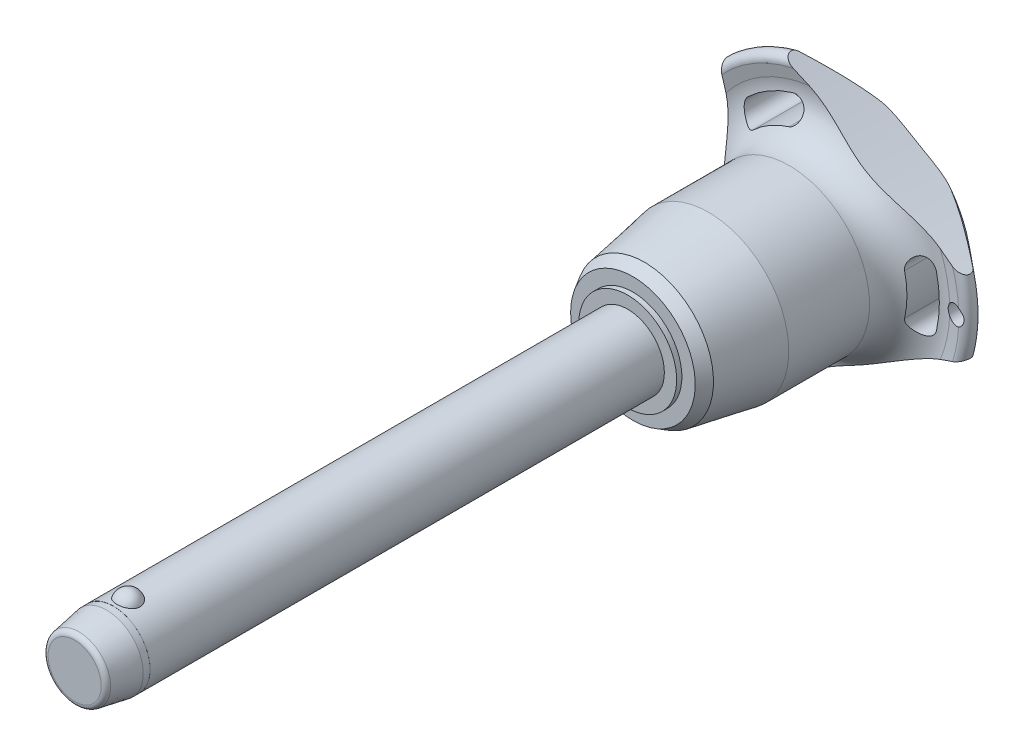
from build123d import *

# Parameters (mm, degrees)
SKETCH1_R           = 6
BOSS_EXTRUDE1_DEPTH = 80
SKETCH2_R           = 5.15
BOSS_EXTRUDE2_DEPTH = 39.7
BOSS_EXTRUDE3_START = 10.6
SKETCH1_2_R         = 6
BOSS_EXTRUDE3_DEPTH = 10.6
CHAMFER1_SIZE       = 5.3
CHAMFER1_SIZE2      = 0.934532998
FILLET1_R           = 0.85
SKETCH6_R           = 144.275
CUT_EXTRUDE1_DEPTH  = 125.345019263
CIRPATTERN1_COUNT   = 3
SKETCH7_R           = 1.5
CUT_EXTRUDE2_DEPTH  = 125.183516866
SKETCH8_R           = 6
SKETCH8_R_2         = 5.99
CUT_EXTRUDE3_DEPTH  = 6.36


with BuildPart() as part:
    # Sketch1 → Boss-Extrude1 (new body)
    with BuildSketch(Plane.XY):
        Circle(SKETCH1_R)
    extrude(amount=-BOSS_EXTRUDE1_DEPTH)

    # Sketch2 → Boss-Extrude2 (add)
    with BuildSketch(Plane(origin=(0, 0, -80), x_dir=(-1, 0, 0), z_dir=(0, 0, -1))):
        Circle(SKETCH2_R)
    extrude(amount=BOSS_EXTRUDE2_DEPTH)

    # Sketch3 → Revolve1 (revolve)
    with BuildSketch(Plane(origin=(0, 0, 0), x_dir=(0, 0, -1), z_dir=(1, 0, 0))):
        with BuildLine():
            Line((-1.854049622, 7.25), (-1.854049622, 3.25))
            ThreePointArc((-1.854049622, 3.25), (0.145950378, 5.25), (-1.854049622, 7.25))
        make_face()
        with BuildLine():
            Line((-1.854049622, -3.25), (-1.854049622, -7.25))
            ThreePointArc((-1.854049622, -7.25), (0.145950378, -5.25), (-1.854049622, -3.25))
        make_face()
    revolve(axis=Axis((0, -3.25, 1.854049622), (0, 1, 0)))

    # Sketch1_2 → Boss-Extrude3 (add)
    with BuildSketch(Plane.XY.offset(BOSS_EXTRUDE3_START)):
        Circle(SKETCH1_2_R)
    extrude(amount=-BOSS_EXTRUDE3_DEPTH)

    # Chamfer1
    chamfer1_edges = [part.edges().sort_by_distance(p)[0] for p in [
        (-6, 0, 10.6),
    ]]
    chamfer1_side = [part.faces().sort_by_distance(p)[0] for p in [
        (-6, 0, -34.7),
    ]]
    chamfer(chamfer1_edges, length=CHAMFER1_SIZE, length2=CHAMFER1_SIZE2, reference=chamfer1_side[0])

    # Fillet1
    fillet1_edges = [part.edges().sort_by_distance(p)[0] for p in [
        (-5.065467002, 0, 10.6),
        (5.15, 0, -119.7),
    ]]
    fillet(fillet1_edges, radius=FILLET1_R)

    # Sketch4 → Revolve2 (revolve)
    with BuildSketch(Plane(origin=(0, 0, 0), x_dir=(0, 0, -1), z_dir=(1, 0, 0)), mode=Mode.PRIVATE) as revolve2_sk:
        Polygon((80, 0), (80, 8.017240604), (80.85, 8.017240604), (80.85, 10.206249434), (82.745737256, 11.300753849), (93.233333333, 13.15), (106.466666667, 13.15), (106.466666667, 0), align=None)
    revolve(revolve2_sk.sketch.rotate(Axis((0, 0, -106.466666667), (0, 0, 1)), 90), axis=Axis((0, 0, -106.466666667), (0, 0, 1)))

    # Sketch5 → Revolve3 (revolve)
    with BuildSketch(Plane(origin=(0, 0, 0), x_dir=(0, 0, -1), z_dir=(1, 0, 0)), mode=Mode.PRIVATE) as revolve3_sk:
        with BuildLine():
            Line((112.32877039, 20.428960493), (111.910912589, 22.344207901))
            ThreePointArc((111.910912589, 22.344207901), (112.554394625, 23.677136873), (114.002586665, 23.371345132))
            Line((114.002586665, 23.371345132), (119.141488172, 17.247040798))
            ThreePointArc((119.141488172, 17.247040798), (119.7, 15.584758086), (118.978803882, 13.986322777))
            ThreePointArc((118.978803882, 13.986322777), (114.617427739, 7.589034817), (113.083333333, 0))
            Line((113.083333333, 0), (106.466666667, 0))
            Line((106.466666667, 0), (106.466666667, 13.15))
            ThreePointArc((106.466666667, 13.15), (111.139661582, 15.38660811), (112.32877039, 20.428960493))
        make_face()
    revolve(revolve3_sk.sketch.rotate(Axis((0, 0, -113.083333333), (0, 0, 1)), 90), axis=Axis((0, 0, -113.083333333), (0, 0, 1)))

    # Sketch6 → Cut-Extrude1 (cut, through all)
    with BuildSketch(Plane.XY):
        with Locations((-159.975, 0)):
            Circle(SKETCH6_R)
        with BuildLine():
            ThreePointArc((18.131206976, -4.190753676), (18.60922037, 0), (18.131206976, 4.190753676))
            ThreePointArc((18.131206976, 4.190753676), (15.94840906, 5.553949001), (14.585213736, 3.371151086))
            ThreePointArc((14.585213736, 3.371151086), (14.969740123, 0), (14.585213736, -3.371151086))
            ThreePointArc((14.585213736, -3.371151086), (15.94840906, -5.553949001), (18.131206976, -4.190753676))
        make_face()
    cut_extrude1 = extrude(amount=-CUT_EXTRUDE1_DEPTH, mode=Mode.SUBTRACT)

    # CirPattern1: Cut-Extrude1 ×3 about axis
    cirpattern1_axis = Axis((0, 0, 0), (0, 0, 1))
    for i in range(1, CIRPATTERN1_COUNT):
        add(cut_extrude1.rotate(cirpattern1_axis, i * 360 / CIRPATTERN1_COUNT), mode=Mode.SUBTRACT)

    # Sketch7 → Cut-Extrude2 (cut, through all)
    with BuildSketch(Plane.XY):
        with Locations(Location((21.60922037, 0, 0), (0, 0, 297.620773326))):
            Circle(SKETCH7_R)
    extrude(amount=-CUT_EXTRUDE2_DEPTH, mode=Mode.SUBTRACT)

    # Sketch8 → Cut-Extrude3 (cut)
    with BuildSketch(Plane.XY.offset(10.6)):
        Circle(SKETCH8_R)
        Circle(SKETCH8_R_2, mode=Mode.SUBTRACT)
    extrude(amount=-CUT_EXTRUDE3_DEPTH, mode=Mode.SUBTRACT)


solid = part.part
